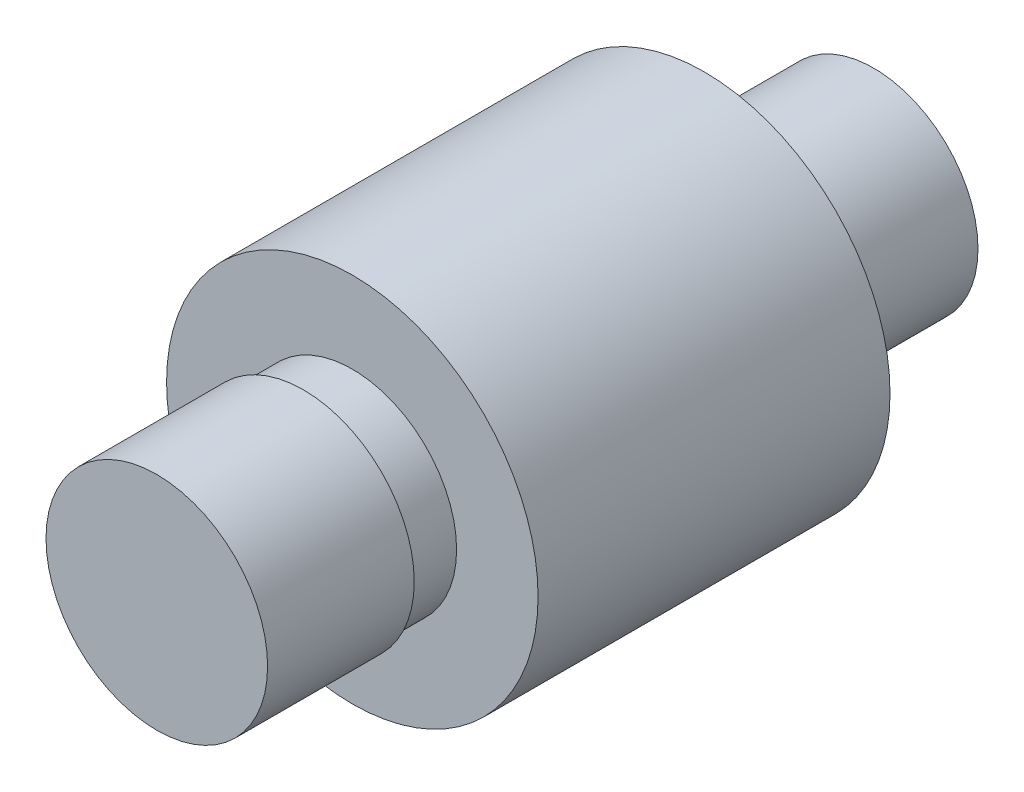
ISO-10303-21;
HEADER;
FILE_DESCRIPTION(('STEP AP214'),'2;1');
FILE_NAME('part.step','',(''),(''),'','','');
FILE_SCHEMA(('AUTOMOTIVE_DESIGN { 1 0 10303 214 1 1 1 1 }'));
ENDSEC;
DATA;
#1=APPLICATION_CONTEXT('core data for automotive mechanical design processes');
#2=APPLICATION_PROTOCOL_DEFINITION('international standard','automotive_design',2000,#1);
#3=PRODUCT_CONTEXT('',#1,'mechanical');
#4=PRODUCT('Part','Part','',(#3));
#5=PRODUCT_RELATED_PRODUCT_CATEGORY('part','',(#4));
#6=PRODUCT_DEFINITION_FORMATION('','',#4);
#7=PRODUCT_DEFINITION_CONTEXT('part definition',#1,'design');
#8=PRODUCT_DEFINITION('design','',#6,#7);
#9=PRODUCT_DEFINITION_SHAPE('','',#8);
#10=(LENGTH_UNIT() NAMED_UNIT(*) SI_UNIT(.MILLI.,.METRE.));
#11=(NAMED_UNIT(*) PLANE_ANGLE_UNIT() SI_UNIT($,.RADIAN.));
#12=(NAMED_UNIT(*) SI_UNIT($,.STERADIAN.) SOLID_ANGLE_UNIT());
#13=UNCERTAINTY_MEASURE_WITH_UNIT(LENGTH_MEASURE(1.E-05),#10,'distance_accuracy_value','');
#14=(GEOMETRIC_REPRESENTATION_CONTEXT(3) GLOBAL_UNCERTAINTY_ASSIGNED_CONTEXT((#13)) GLOBAL_UNIT_ASSIGNED_CONTEXT((#10,
#11,#12)) REPRESENTATION_CONTEXT('',''));
#15=CARTESIAN_POINT('',(0.,0.,0.));
#16=DIRECTION('',(0.,0.,1.));
#17=DIRECTION('',(1.,0.,0.));
#18=AXIS2_PLACEMENT_3D('',#15,#16,#17);
#19=CARTESIAN_POINT('',(0.,0.,112.5));
#20=DIRECTION('',(0.,0.,-1.));
#21=DIRECTION('',(-1.,0.,0.));
#22=AXIS2_PLACEMENT_3D('',#19,#20,#21);
#23=CYLINDRICAL_SURFACE('',#22,85.);
#24=CARTESIAN_POINT('',(0.,0.,112.5));
#25=DIRECTION('',(0.,0.,1.));
#26=DIRECTION('',(1.,0.,0.));
#27=AXIS2_PLACEMENT_3D('',#24,#25,#26);
#28=CIRCLE('',#27,85.);
#29=CARTESIAN_POINT('',(85.,0.,112.5));
#30=VERTEX_POINT('',#29);
#31=EDGE_CURVE('E53',#30,#30,#28,.T.);
#32=ORIENTED_EDGE('',*,*,#31,.F.);
#33=EDGE_LOOP('',(#32));
#34=FACE_BOUND('',#33,.T.);
#35=CARTESIAN_POINT('',(0.,0.,0.));
#36=DIRECTION('',(0.,0.,1.));
#37=DIRECTION('',(1.,0.,0.));
#38=AXIS2_PLACEMENT_3D('',#35,#36,#37);
#39=CIRCLE('',#38,85.);
#40=CARTESIAN_POINT('',(85.,0.,0.));
#41=VERTEX_POINT('',#40);
#42=EDGE_CURVE('E42',#41,#41,#39,.T.);
#43=ORIENTED_EDGE('',*,*,#42,.T.);
#44=EDGE_LOOP('',(#43));
#45=FACE_BOUND('',#44,.T.);
#46=ADVANCED_FACE('F39',(#34,#45),#23,.T.);
#47=CARTESIAN_POINT('',(0.,0.,112.5));
#48=DIRECTION('',(0.,0.,1.));
#49=DIRECTION('',(1.,0.,0.));
#50=AXIS2_PLACEMENT_3D('',#47,#48,#49);
#51=PLANE('',#50);
#52=ORIENTED_EDGE('',*,*,#31,.T.);
#53=EDGE_LOOP('',(#52));
#54=FACE_BOUND('',#53,.T.);
#55=ADVANCED_FACE('F81',(#54),#51,.T.);
#56=CARTESIAN_POINT('',(0.,0.,0.));
#57=DIRECTION('',(0.,0.,1.));
#58=DIRECTION('',(1.,0.,0.));
#59=AXIS2_PLACEMENT_3D('',#56,#57,#58);
#60=PLANE('',#59);
#61=CARTESIAN_POINT('',(0.,0.,0.));
#62=DIRECTION('',(0.,0.,-1.));
#63=DIRECTION('',(-1.,0.,0.));
#64=AXIS2_PLACEMENT_3D('',#61,#62,#63);
#65=CIRCLE('',#64,80.);
#66=CARTESIAN_POINT('',(-80.,0.,0.));
#67=VERTEX_POINT('',#66);
#68=EDGE_CURVE('E47',#67,#67,#65,.T.);
#69=ORIENTED_EDGE('',*,*,#68,.F.);
#70=EDGE_LOOP('',(#69));
#71=FACE_BOUND('',#70,.T.);
#72=ORIENTED_EDGE('',*,*,#42,.F.);
#73=EDGE_LOOP('',(#72));
#74=FACE_BOUND('',#73,.T.);
#75=ADVANCED_FACE('F78',(#71,#74),#60,.F.);
#76=CARTESIAN_POINT('',(0.,0.,-37.5));
#77=DIRECTION('',(0.,0.,1.));
#78=DIRECTION('',(1.,0.,0.));
#79=AXIS2_PLACEMENT_3D('',#76,#77,#78);
#80=CYLINDRICAL_SURFACE('',#79,80.);
#81=CARTESIAN_POINT('',(0.,0.,-37.5));
#82=DIRECTION('',(0.,0.,-1.));
#83=DIRECTION('',(-1.,0.,0.));
#84=AXIS2_PLACEMENT_3D('',#81,#82,#83);
#85=CIRCLE('',#84,80.);
#86=CARTESIAN_POINT('',(-80.,0.,-37.5));
#87=VERTEX_POINT('',#86);
#88=EDGE_CURVE('E62',#87,#87,#85,.T.);
#89=ORIENTED_EDGE('',*,*,#88,.F.);
#90=EDGE_LOOP('',(#89));
#91=FACE_BOUND('',#90,.T.);
#92=ORIENTED_EDGE('',*,*,#68,.T.);
#93=EDGE_LOOP('',(#92));
#94=FACE_BOUND('',#93,.T.);
#95=ADVANCED_FACE('F80',(#91,#94),#80,.T.);
#96=CARTESIAN_POINT('',(0.,0.,-307.5));
#97=DIRECTION('',(0.,0.,1.));
#98=DIRECTION('',(1.,0.,0.));
#99=AXIS2_PLACEMENT_3D('',#96,#97,#98);
#100=CYLINDRICAL_SURFACE('',#99,142.5);
#101=CARTESIAN_POINT('',(0.,0.,-307.5));
#102=DIRECTION('',(0.,0.,-1.));
#103=DIRECTION('',(-1.,0.,0.));
#104=AXIS2_PLACEMENT_3D('',#101,#102,#103);
#105=CIRCLE('',#104,142.5);
#106=CARTESIAN_POINT('',(-142.5,0.,-307.5));
#107=VERTEX_POINT('',#106);
#108=EDGE_CURVE('E58',#107,#107,#105,.T.);
#109=ORIENTED_EDGE('',*,*,#108,.F.);
#110=EDGE_LOOP('',(#109));
#111=FACE_BOUND('',#110,.T.);
#112=CARTESIAN_POINT('',(0.,0.,-37.5));
#113=DIRECTION('',(0.,0.,-1.));
#114=DIRECTION('',(-1.,0.,0.));
#115=AXIS2_PLACEMENT_3D('',#112,#113,#114);
#116=CIRCLE('',#115,142.5);
#117=CARTESIAN_POINT('',(-142.5,0.,-37.5));
#118=VERTEX_POINT('',#117);
#119=EDGE_CURVE('E63',#118,#118,#116,.T.);
#120=ORIENTED_EDGE('',*,*,#119,.T.);
#121=EDGE_LOOP('',(#120));
#122=FACE_BOUND('',#121,.T.);
#123=ADVANCED_FACE('F87',(#111,#122),#100,.T.);
#124=CARTESIAN_POINT('',(0.,0.,-307.5));
#125=DIRECTION('',(0.,0.,-1.));
#126=DIRECTION('',(-1.,0.,0.));
#127=AXIS2_PLACEMENT_3D('',#124,#125,#126);
#128=PLANE('',#127);
#129=CARTESIAN_POINT('',(0.,0.,-307.5));
#130=DIRECTION('',(0.,0.,-1.));
#131=DIRECTION('',(-1.,0.,0.));
#132=AXIS2_PLACEMENT_3D('',#129,#130,#131);
#133=CIRCLE('',#132,80.);
#134=CARTESIAN_POINT('',(-80.,0.,-307.5));
#135=VERTEX_POINT('',#134);
#136=EDGE_CURVE('E10',#135,#135,#133,.T.);
#137=ORIENTED_EDGE('',*,*,#136,.F.);
#138=EDGE_LOOP('',(#137));
#139=FACE_BOUND('',#138,.T.);
#140=ORIENTED_EDGE('',*,*,#108,.T.);
#141=EDGE_LOOP('',(#140));
#142=FACE_BOUND('',#141,.T.);
#143=ADVANCED_FACE('F119',(#139,#142),#128,.T.);
#144=CARTESIAN_POINT('',(0.,0.,-37.5));
#145=DIRECTION('',(0.,0.,-1.));
#146=DIRECTION('',(-1.,0.,0.));
#147=AXIS2_PLACEMENT_3D('',#144,#145,#146);
#148=PLANE('',#147);
#149=ORIENTED_EDGE('',*,*,#88,.T.);
#150=EDGE_LOOP('',(#149));
#151=FACE_BOUND('',#150,.T.);
#152=ORIENTED_EDGE('',*,*,#119,.F.);
#153=EDGE_LOOP('',(#152));
#154=FACE_BOUND('',#153,.T.);
#155=ADVANCED_FACE('F127',(#151,#154),#148,.F.);
#156=CARTESIAN_POINT('',(0.,0.,-437.5));
#157=DIRECTION('',(0.,0.,1.));
#158=DIRECTION('',(1.,0.,0.));
#159=AXIS2_PLACEMENT_3D('',#156,#157,#158);
#160=CYLINDRICAL_SURFACE('',#159,80.);
#161=CARTESIAN_POINT('',(0.,0.,-437.5));
#162=DIRECTION('',(0.,0.,-1.));
#163=DIRECTION('',(-1.,0.,0.));
#164=AXIS2_PLACEMENT_3D('',#161,#162,#163);
#165=CIRCLE('',#164,80.);
#166=CARTESIAN_POINT('',(-80.,0.,-437.5));
#167=VERTEX_POINT('',#166);
#168=EDGE_CURVE('E57',#167,#167,#165,.T.);
#169=ORIENTED_EDGE('',*,*,#168,.F.);
#170=EDGE_LOOP('',(#169));
#171=FACE_BOUND('',#170,.T.);
#172=ORIENTED_EDGE('',*,*,#136,.T.);
#173=EDGE_LOOP('',(#172));
#174=FACE_BOUND('',#173,.T.);
#175=ADVANCED_FACE('F132',(#171,#174),#160,.T.);
#176=CARTESIAN_POINT('',(0.,0.,-437.5));
#177=DIRECTION('',(0.,0.,-1.));
#178=DIRECTION('',(-1.,0.,0.));
#179=AXIS2_PLACEMENT_3D('',#176,#177,#178);
#180=PLANE('',#179);
#181=ORIENTED_EDGE('',*,*,#168,.T.);
#182=EDGE_LOOP('',(#181));
#183=FACE_BOUND('',#182,.T.);
#184=ADVANCED_FACE('F149',(#183),#180,.T.);
#185=CLOSED_SHELL('',(#46,#55,#75,#95,#123,#143,#155,#175,#184));
#186=MANIFOLD_SOLID_BREP('B2',#185);
#187=ADVANCED_BREP_SHAPE_REPRESENTATION('',(#18,#186),#14);
#188=SHAPE_DEFINITION_REPRESENTATION(#9,#187);
ENDSEC;
END-ISO-10303-21;
